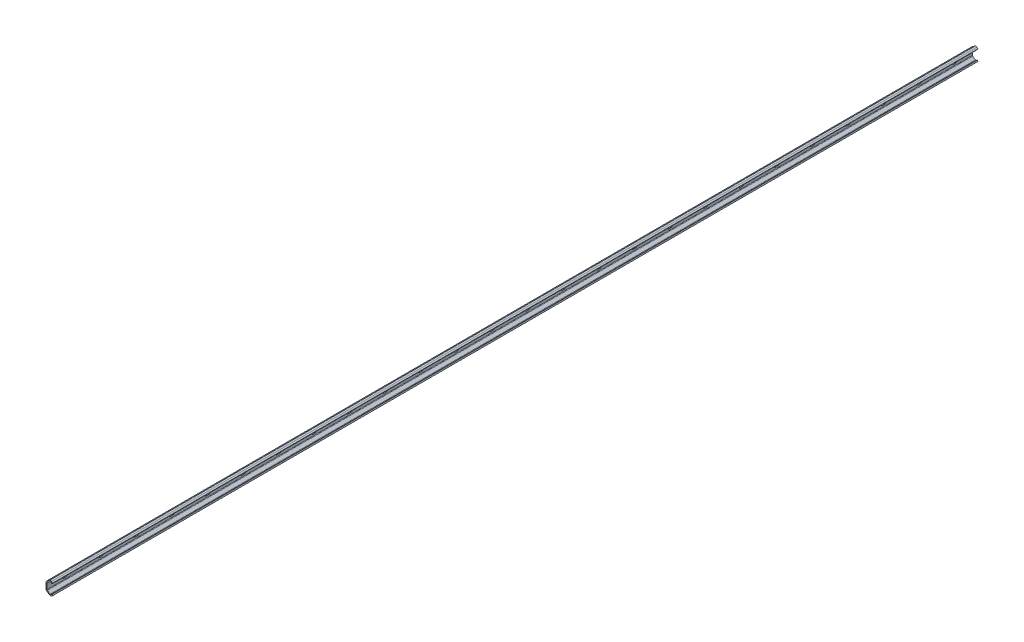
from build123d import *

# Parameters (mm, degrees)
EXTRUDE1_DEPTH  = 2080
EXTRUDE2_DEPTH  = 2081.090775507
LPATTERN1_COUNT = 26
LPATTERN1_PITCH = 80


with BuildPart() as part:
    # Sketch1 → Extrude1 (new body)
    with BuildSketch(Plane.XY):
        with BuildLine():
            Line((13.566058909, -10.161082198), (15, -12.208962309))
            Line((15, -12.208962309), (12.158978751, -14.198266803))
            ThreePointArc((12.158978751, -14.198266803), (10, -14.878990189), (7.841021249, -14.198266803))
            Line((7.841021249, -14.198266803), (2.07234263, -10.158994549))
            ThreePointArc((2.07234263, -10.158994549), (0.593144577, -8.506805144), (0, -6.37))
            Line((0, -6.37), (0, 6.37))
            ThreePointArc((0, 6.37), (0.551933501, 8.529345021), (2.07234263, 10.158994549))
            Line((2.07234263, 10.158994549), (7.841021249, 14.198266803))
            ThreePointArc((7.841021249, 14.198266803), (10, 14.878990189), (12.158978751, 14.198266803))
            Line((12.158978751, 14.198266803), (15, 12.208962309))
            Line((15, 12.208962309), (13.566058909, 10.161082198))
            Line((13.566058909, 10.161082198), (10.861016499, 12.055173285))
            ThreePointArc((10.861016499, 12.055173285), (10, 12.326650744), (9.138983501, 12.055173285))
            Line((9.138983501, 12.055173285), (3.254206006, 7.934607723))
            ThreePointArc((3.254206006, 7.934607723), (2.672861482, 7.25075677), (2.5, 6.37))
            Line((2.5, 6.37), (2.5, -6.37))
            ThreePointArc((2.5, -6.37), (2.698391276, -7.238450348), (3.254206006, -7.934607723))
            Line((3.254206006, -7.934607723), (9.138983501, -12.055173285))
            ThreePointArc((9.138983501, -12.055173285), (10, -12.326650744), (10.861016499, -12.055173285))
            Line((10.861016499, -12.055173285), (13.566058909, -10.161082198))
        make_face()
    extrude(amount=-EXTRUDE1_DEPTH)

    # Sketch3 → Extrude2 (cut, through all)
    with BuildSketch(Plane(origin=(2.5, 0, 0), x_dir=(0, 0, -1), z_dir=(1, 0, 0))):
        with BuildLine():
            Line((37.5, 3), (42.5, 3))
            ThreePointArc((42.5, 3), (45.5, 0), (42.5, -3))
            Line((42.5, -3), (37.5, -3))
            ThreePointArc((37.5, -3), (34.5, 0), (37.5, 3))
        make_face()
    extrude2 = extrude(amount=-EXTRUDE2_DEPTH, mode=Mode.SUBTRACT)

    # LPattern1: Extrude2 ×26
    with Locations(*[(0, 0, -i * LPATTERN1_PITCH) for i in range(1, LPATTERN1_COUNT)]):
        add(extrude2, mode=Mode.SUBTRACT)


solid = part.part
